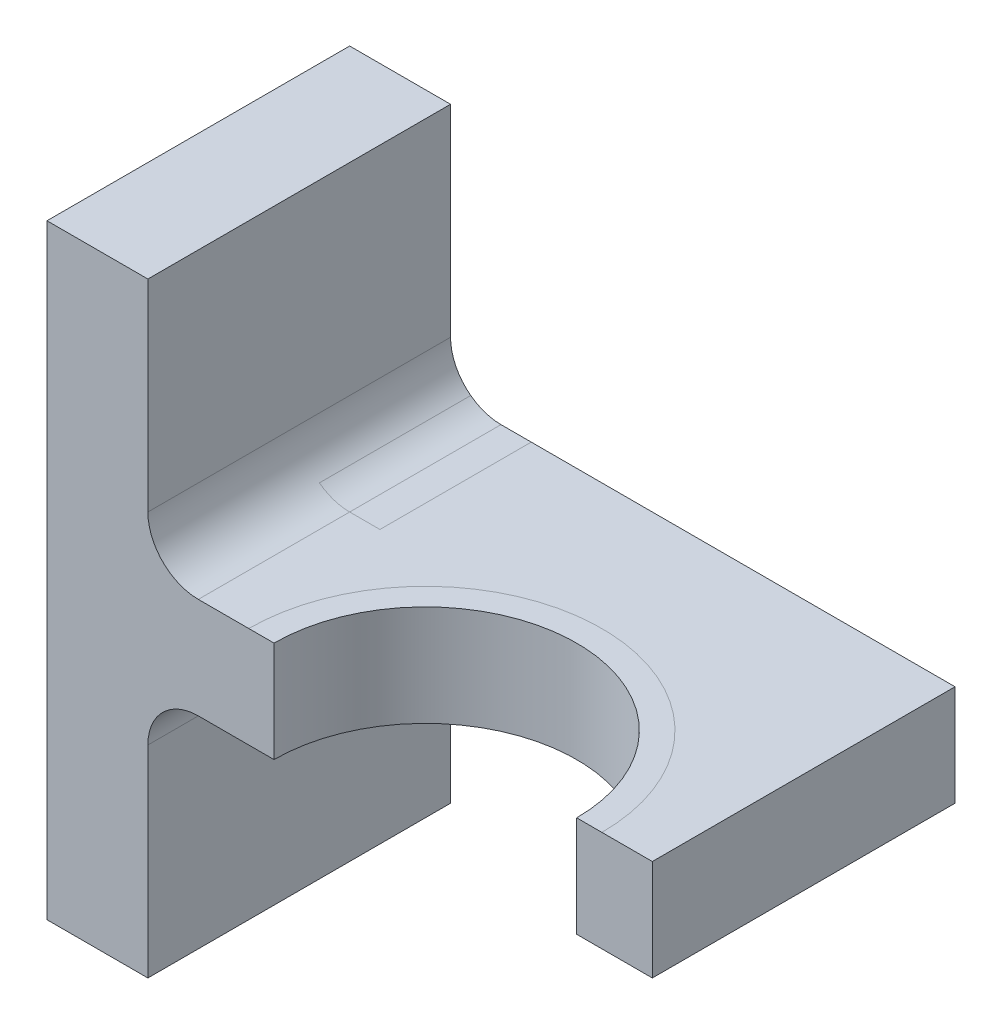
ISO-10303-21;
HEADER;
FILE_DESCRIPTION(('STEP AP214'),'2;1');
FILE_NAME('part.step','',(''),(''),'','','');
FILE_SCHEMA(('AUTOMOTIVE_DESIGN { 1 0 10303 214 1 1 1 1 }'));
ENDSEC;
DATA;
#1=APPLICATION_CONTEXT('core data for automotive mechanical design processes');
#2=APPLICATION_PROTOCOL_DEFINITION('international standard','automotive_design',2000,#1);
#3=PRODUCT_CONTEXT('',#1,'mechanical');
#4=PRODUCT('Part','Part','',(#3));
#5=PRODUCT_RELATED_PRODUCT_CATEGORY('part','',(#4));
#6=PRODUCT_DEFINITION_FORMATION('','',#4);
#7=PRODUCT_DEFINITION_CONTEXT('part definition',#1,'design');
#8=PRODUCT_DEFINITION('design','',#6,#7);
#9=PRODUCT_DEFINITION_SHAPE('','',#8);
#10=(LENGTH_UNIT() NAMED_UNIT(*) SI_UNIT(.MILLI.,.METRE.));
#11=(NAMED_UNIT(*) PLANE_ANGLE_UNIT() SI_UNIT($,.RADIAN.));
#12=(NAMED_UNIT(*) SI_UNIT($,.STERADIAN.) SOLID_ANGLE_UNIT());
#13=UNCERTAINTY_MEASURE_WITH_UNIT(LENGTH_MEASURE(1.E-05),#10,'distance_accuracy_value','');
#14=(GEOMETRIC_REPRESENTATION_CONTEXT(3) GLOBAL_UNCERTAINTY_ASSIGNED_CONTEXT((#13)) GLOBAL_UNIT_ASSIGNED_CONTEXT((#10,
#11,#12)) REPRESENTATION_CONTEXT('',''));
#15=CARTESIAN_POINT('',(0.,0.,0.));
#16=DIRECTION('',(0.,0.,1.));
#17=DIRECTION('',(1.,0.,0.));
#18=AXIS2_PLACEMENT_3D('',#15,#16,#17);
#19=CARTESIAN_POINT('',(20.,-10.,60.));
#20=DIRECTION('',(0.,1.,0.));
#21=DIRECTION('',(-1.,0.,0.));
#22=AXIS2_PLACEMENT_3D('',#19,#20,#21);
#23=PLANE('',#22);
#24=DIRECTION('',(-1.,0.,0.));
#25=VECTOR('',#24,1.);
#26=CARTESIAN_POINT('',(20.,-10.,-30.));
#27=LINE('',#26,#25);
#28=CARTESIAN_POINT('',(36.,-10.,-30.));
#29=VERTEX_POINT('',#28);
#30=CARTESIAN_POINT('',(30.,-10.,-30.));
#31=VERTEX_POINT('',#30);
#32=EDGE_CURVE('E11',#29,#31,#27,.T.);
#33=ORIENTED_EDGE('',*,*,#32,.F.);
#34=DIRECTION('',(0.,0.,1.));
#35=VECTOR('',#34,1.);
#36=CARTESIAN_POINT('',(36.,-10.,60.));
#37=LINE('',#36,#35);
#38=CARTESIAN_POINT('',(36.,-10.,-60.));
#39=VERTEX_POINT('',#38);
#40=EDGE_CURVE('E43',#39,#29,#37,.T.);
#41=ORIENTED_EDGE('',*,*,#40,.F.);
#42=DIRECTION('',(1.,0.,0.));
#43=VECTOR('',#42,1.);
#44=CARTESIAN_POINT('',(20.,-10.,-60.));
#45=LINE('',#44,#43);
#46=CARTESIAN_POINT('',(120.,-10.,-60.));
#47=VERTEX_POINT('',#46);
#48=EDGE_CURVE('E203',#39,#47,#45,.T.);
#49=ORIENTED_EDGE('',*,*,#48,.T.);
#50=DIRECTION('',(0.,0.,-1.));
#51=VECTOR('',#50,1.);
#52=CARTESIAN_POINT('',(120.,-10.,60.));
#53=LINE('',#52,#51);
#54=CARTESIAN_POINT('',(120.,-10.,0.));
#55=VERTEX_POINT('',#54);
#56=EDGE_CURVE('E226',#55,#47,#53,.T.);
#57=ORIENTED_EDGE('',*,*,#56,.F.);
#58=DIRECTION('',(-1.,0.,0.));
#59=VECTOR('',#58,1.);
#60=CARTESIAN_POINT('',(20.,-10.,0.));
#61=LINE('',#60,#59);
#62=CARTESIAN_POINT('',(110.,-10.,0.));
#63=VERTEX_POINT('',#62);
#64=EDGE_CURVE('E324',#55,#63,#61,.T.);
#65=ORIENTED_EDGE('',*,*,#64,.T.);
#66=CARTESIAN_POINT('',(75.,-10.,0.));
#67=DIRECTION('',(0.,1.,0.));
#68=DIRECTION('',(-1.,0.,0.));
#69=AXIS2_PLACEMENT_3D('',#66,#67,#68);
#70=CIRCLE('',#69,35.);
#71=CARTESIAN_POINT('',(40.,-10.,0.));
#72=VERTEX_POINT('',#71);
#73=EDGE_CURVE('E173',#72,#63,#70,.F.);
#74=ORIENTED_EDGE('',*,*,#73,.F.);
#75=CARTESIAN_POINT('',(30.,-10.,0.));
#76=VERTEX_POINT('',#75);
#77=EDGE_CURVE('E320',#72,#76,#61,.T.);
#78=ORIENTED_EDGE('',*,*,#77,.T.);
#79=DIRECTION('',(0.,0.,-1.));
#80=VECTOR('',#79,1.);
#81=CARTESIAN_POINT('',(30.,-10.,-60.));
#82=LINE('',#81,#80);
#83=EDGE_CURVE('E234',#76,#31,#82,.T.);
#84=ORIENTED_EDGE('',*,*,#83,.T.);
#85=EDGE_LOOP('',(#33,#41,#49,#57,#65,#74,#78,#84));
#86=FACE_BOUND('',#85,.T.);
#87=ADVANCED_FACE('F33',(#86),#23,.F.);
#88=CARTESIAN_POINT('',(30.,-20.,60.));
#89=DIRECTION('',(0.,0.,1.));
#90=DIRECTION('',(1.,0.,0.));
#91=AXIS2_PLACEMENT_3D('',#88,#89,#90);
#92=CYLINDRICAL_SURFACE('',#91,10.);
#93=DIRECTION('',(0.,0.,1.));
#94=VECTOR('',#93,1.);
#95=CARTESIAN_POINT('',(24.,-12.,60.));
#96=LINE('',#95,#94);
#97=CARTESIAN_POINT('',(24.,-12.,-30.));
#98=VERTEX_POINT('',#97);
#99=CARTESIAN_POINT('',(24.,-12.,-60.));
#100=VERTEX_POINT('',#99);
#101=EDGE_CURVE('E272',#98,#100,#96,.F.);
#102=ORIENTED_EDGE('',*,*,#101,.F.);
#103=CARTESIAN_POINT('',(30.,-20.,-30.));
#104=DIRECTION('',(0.,0.,-1.));
#105=DIRECTION('',(-1.,0.,0.));
#106=AXIS2_PLACEMENT_3D('',#103,#104,#105);
#107=CIRCLE('',#106,10.);
#108=EDGE_CURVE('E274',#31,#98,#107,.F.);
#109=ORIENTED_EDGE('',*,*,#108,.F.);
#110=ORIENTED_EDGE('',*,*,#83,.F.);
#111=CARTESIAN_POINT('',(30.,-20.,0.));
#112=DIRECTION('',(0.,0.,-1.));
#113=DIRECTION('',(-1.,0.,0.));
#114=AXIS2_PLACEMENT_3D('',#111,#112,#113);
#115=CIRCLE('',#114,10.);
#116=CARTESIAN_POINT('',(20.,-20.,0.));
#117=VERTEX_POINT('',#116);
#118=EDGE_CURVE('E331',#76,#117,#115,.F.);
#119=ORIENTED_EDGE('',*,*,#118,.T.);
#120=DIRECTION('',(0.,0.,-1.));
#121=VECTOR('',#120,1.);
#122=CARTESIAN_POINT('',(20.,-20.,60.));
#123=LINE('',#122,#121);
#124=CARTESIAN_POINT('',(20.,-20.,-60.));
#125=VERTEX_POINT('',#124);
#126=EDGE_CURVE('E236',#125,#117,#123,.F.);
#127=ORIENTED_EDGE('',*,*,#126,.F.);
#128=CARTESIAN_POINT('',(30.,-20.,-60.));
#129=DIRECTION('',(0.,0.,-1.));
#130=DIRECTION('',(-1.,0.,0.));
#131=AXIS2_PLACEMENT_3D('',#128,#129,#130);
#132=CIRCLE('',#131,10.);
#133=EDGE_CURVE('E245',#100,#125,#132,.F.);
#134=ORIENTED_EDGE('',*,*,#133,.F.);
#135=EDGE_LOOP('',(#102,#109,#110,#119,#127,#134));
#136=FACE_BOUND('',#135,.T.);
#137=ADVANCED_FACE('F364',(#136),#92,.F.);
#138=CARTESIAN_POINT('',(20.,10.,60.));
#139=DIRECTION('',(0.,-1.,0.));
#140=DIRECTION('',(1.,0.,0.));
#141=AXIS2_PLACEMENT_3D('',#138,#139,#140);
#142=PLANE('',#141);
#143=DIRECTION('',(1.,0.,0.));
#144=VECTOR('',#143,1.);
#145=CARTESIAN_POINT('',(20.,10.,-30.));
#146=LINE('',#145,#144);
#147=CARTESIAN_POINT('',(30.,10.,-30.));
#148=VERTEX_POINT('',#147);
#149=CARTESIAN_POINT('',(36.,10.,-30.));
#150=VERTEX_POINT('',#149);
#151=EDGE_CURVE('E37',#148,#150,#146,.T.);
#152=ORIENTED_EDGE('',*,*,#151,.F.);
#153=DIRECTION('',(0.,0.,-1.));
#154=VECTOR('',#153,1.);
#155=CARTESIAN_POINT('',(30.,10.,60.));
#156=LINE('',#155,#154);
#157=CARTESIAN_POINT('',(30.,10.,0.));
#158=VERTEX_POINT('',#157);
#159=EDGE_CURVE('E241',#148,#158,#156,.F.);
#160=ORIENTED_EDGE('',*,*,#159,.T.);
#161=DIRECTION('',(1.,0.,0.));
#162=VECTOR('',#161,1.);
#163=CARTESIAN_POINT('',(20.,10.,0.));
#164=LINE('',#163,#162);
#165=CARTESIAN_POINT('',(40.,10.,0.));
#166=VERTEX_POINT('',#165);
#167=EDGE_CURVE('E314',#158,#166,#164,.T.);
#168=ORIENTED_EDGE('',*,*,#167,.T.);
#169=CARTESIAN_POINT('',(75.,10.,0.));
#170=DIRECTION('',(0.,-1.,0.));
#171=DIRECTION('',(1.,0.,0.));
#172=AXIS2_PLACEMENT_3D('',#169,#170,#171);
#173=CIRCLE('',#172,35.);
#174=CARTESIAN_POINT('',(110.,10.,0.));
#175=VERTEX_POINT('',#174);
#176=EDGE_CURVE('E252',#175,#166,#173,.F.);
#177=ORIENTED_EDGE('',*,*,#176,.F.);
#178=CARTESIAN_POINT('',(120.,10.,0.));
#179=VERTEX_POINT('',#178);
#180=EDGE_CURVE('E182',#175,#179,#164,.T.);
#181=ORIENTED_EDGE('',*,*,#180,.T.);
#182=DIRECTION('',(0.,0.,-1.));
#183=VECTOR('',#182,1.);
#184=CARTESIAN_POINT('',(120.,10.,60.));
#185=LINE('',#184,#183);
#186=CARTESIAN_POINT('',(120.,10.,-60.));
#187=VERTEX_POINT('',#186);
#188=EDGE_CURVE('E224',#179,#187,#185,.T.);
#189=ORIENTED_EDGE('',*,*,#188,.T.);
#190=DIRECTION('',(-1.,0.,0.));
#191=VECTOR('',#190,1.);
#192=CARTESIAN_POINT('',(20.,10.,-60.));
#193=LINE('',#192,#191);
#194=CARTESIAN_POINT('',(36.,10.,-60.));
#195=VERTEX_POINT('',#194);
#196=EDGE_CURVE('E211',#187,#195,#193,.T.);
#197=ORIENTED_EDGE('',*,*,#196,.T.);
#198=DIRECTION('',(0.,0.,-1.));
#199=VECTOR('',#198,1.);
#200=CARTESIAN_POINT('',(36.,10.,60.));
#201=LINE('',#200,#199);
#202=EDGE_CURVE('E267',#150,#195,#201,.T.);
#203=ORIENTED_EDGE('',*,*,#202,.F.);
#204=EDGE_LOOP('',(#152,#160,#168,#177,#181,#189,#197,#203));
#205=FACE_BOUND('',#204,.T.);
#206=ADVANCED_FACE('F291',(#205),#142,.F.);
#207=CARTESIAN_POINT('',(30.,20.,60.));
#208=DIRECTION('',(0.,0.,1.));
#209=DIRECTION('',(1.,0.,0.));
#210=AXIS2_PLACEMENT_3D('',#207,#208,#209);
#211=CYLINDRICAL_SURFACE('',#210,10.);
#212=DIRECTION('',(0.,0.,1.));
#213=VECTOR('',#212,1.);
#214=CARTESIAN_POINT('',(24.,12.,60.));
#215=LINE('',#214,#213);
#216=CARTESIAN_POINT('',(24.,12.,-60.));
#217=VERTEX_POINT('',#216);
#218=CARTESIAN_POINT('',(24.,12.,-30.));
#219=VERTEX_POINT('',#218);
#220=EDGE_CURVE('E264',#217,#219,#215,.T.);
#221=ORIENTED_EDGE('',*,*,#220,.F.);
#222=CARTESIAN_POINT('',(30.,20.,-60.));
#223=DIRECTION('',(0.,0.,-1.));
#224=DIRECTION('',(-1.,0.,0.));
#225=AXIS2_PLACEMENT_3D('',#222,#223,#224);
#226=CIRCLE('',#225,10.);
#227=CARTESIAN_POINT('',(20.,20.,-60.));
#228=VERTEX_POINT('',#227);
#229=EDGE_CURVE('E250',#228,#217,#226,.F.);
#230=ORIENTED_EDGE('',*,*,#229,.F.);
#231=DIRECTION('',(0.,0.,-1.));
#232=VECTOR('',#231,1.);
#233=CARTESIAN_POINT('',(20.,20.,-60.));
#234=LINE('',#233,#232);
#235=CARTESIAN_POINT('',(20.,20.,0.));
#236=VERTEX_POINT('',#235);
#237=EDGE_CURVE('E239',#236,#228,#234,.T.);
#238=ORIENTED_EDGE('',*,*,#237,.F.);
#239=CARTESIAN_POINT('',(30.,20.,0.));
#240=DIRECTION('',(0.,0.,-1.));
#241=DIRECTION('',(-1.,0.,0.));
#242=AXIS2_PLACEMENT_3D('',#239,#240,#241);
#243=CIRCLE('',#242,10.);
#244=EDGE_CURVE('E310',#236,#158,#243,.F.);
#245=ORIENTED_EDGE('',*,*,#244,.T.);
#246=ORIENTED_EDGE('',*,*,#159,.F.);
#247=CARTESIAN_POINT('',(30.,20.,-30.));
#248=DIRECTION('',(0.,0.,-1.));
#249=DIRECTION('',(-1.,0.,0.));
#250=AXIS2_PLACEMENT_3D('',#247,#248,#249);
#251=CIRCLE('',#250,10.);
#252=EDGE_CURVE('E260',#219,#148,#251,.F.);
#253=ORIENTED_EDGE('',*,*,#252,.F.);
#254=EDGE_LOOP('',(#221,#230,#238,#245,#246,#253));
#255=FACE_BOUND('',#254,.T.);
#256=ADVANCED_FACE('F308',(#255),#211,.F.);
#257=CARTESIAN_POINT('',(-13.194139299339,272.307621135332,0.));
#258=DIRECTION('',(0.,0.,-1.));
#259=DIRECTION('',(-1.,0.,0.));
#260=AXIS2_PLACEMENT_3D('',#257,#258,#259);
#261=PLANE('',#260);
#262=DIRECTION('',(1.,0.,0.));
#263=VECTOR('',#262,1.);
#264=CARTESIAN_POINT('',(0.,60.,0.));
#265=LINE('',#264,#263);
#266=CARTESIAN_POINT('',(0.,60.,0.));
#267=VERTEX_POINT('',#266);
#268=CARTESIAN_POINT('',(20.,60.,0.));
#269=VERTEX_POINT('',#268);
#270=EDGE_CURVE('E193',#267,#269,#265,.T.);
#271=ORIENTED_EDGE('',*,*,#270,.F.);
#272=DIRECTION('',(0.,1.,0.));
#273=VECTOR('',#272,1.);
#274=CARTESIAN_POINT('',(0.,-60.,0.));
#275=LINE('',#274,#273);
#276=CARTESIAN_POINT('',(0.,-60.,0.));
#277=VERTEX_POINT('',#276);
#278=EDGE_CURVE('E341',#277,#267,#275,.T.);
#279=ORIENTED_EDGE('',*,*,#278,.F.);
#280=DIRECTION('',(-1.,0.,0.));
#281=VECTOR('',#280,1.);
#282=CARTESIAN_POINT('',(0.,-60.,0.));
#283=LINE('',#282,#281);
#284=CARTESIAN_POINT('',(20.,-60.,0.));
#285=VERTEX_POINT('',#284);
#286=EDGE_CURVE('E339',#285,#277,#283,.T.);
#287=ORIENTED_EDGE('',*,*,#286,.F.);
#288=DIRECTION('',(0.,-1.,0.));
#289=VECTOR('',#288,1.);
#290=CARTESIAN_POINT('',(20.,-60.,0.));
#291=LINE('',#290,#289);
#292=EDGE_CURVE('E336',#117,#285,#291,.T.);
#293=ORIENTED_EDGE('',*,*,#292,.F.);
#294=ORIENTED_EDGE('',*,*,#118,.F.);
#295=ORIENTED_EDGE('',*,*,#77,.F.);
#296=DIRECTION('',(-1.,0.,0.));
#297=VECTOR('',#296,1.);
#298=CARTESIAN_POINT('',(20.,-10.,0.));
#299=LINE('',#298,#297);
#300=CARTESIAN_POINT('',(45.,-10.,0.));
#301=VERTEX_POINT('',#300);
#302=EDGE_CURVE('E184',#301,#72,#299,.T.);
#303=ORIENTED_EDGE('',*,*,#302,.F.);
#304=DIRECTION('',(0.,1.,0.));
#305=VECTOR('',#304,1.);
#306=CARTESIAN_POINT('',(45.,-60.,0.));
#307=LINE('',#306,#305);
#308=CARTESIAN_POINT('',(45.,10.,0.));
#309=VERTEX_POINT('',#308);
#310=EDGE_CURVE('E172',#309,#301,#307,.F.);
#311=ORIENTED_EDGE('',*,*,#310,.F.);
#312=DIRECTION('',(1.,0.,0.));
#313=VECTOR('',#312,1.);
#314=CARTESIAN_POINT('',(20.,10.,0.));
#315=LINE('',#314,#313);
#316=EDGE_CURVE('E319',#166,#309,#315,.T.);
#317=ORIENTED_EDGE('',*,*,#316,.F.);
#318=ORIENTED_EDGE('',*,*,#167,.F.);
#319=ORIENTED_EDGE('',*,*,#244,.F.);
#320=DIRECTION('',(0.,-1.,0.));
#321=VECTOR('',#320,1.);
#322=CARTESIAN_POINT('',(20.,10.,0.));
#323=LINE('',#322,#321);
#324=EDGE_CURVE('E334',#269,#236,#323,.T.);
#325=ORIENTED_EDGE('',*,*,#324,.F.);
#326=EDGE_LOOP('',(#271,#279,#287,#293,#294,#295,#303,#311,#317,#318,#319,#325));
#327=FACE_BOUND('',#326,.T.);
#328=ADVANCED_FACE('F316',(#327),#261,.F.);
#329=ORIENTED_EDGE('',*,*,#40,.T.);
#330=ORIENTED_EDGE('',*,*,#32,.T.);
#331=CARTESIAN_POINT('',(30.,-10.,-60.));
#332=VERTEX_POINT('',#331);
#333=EDGE_CURVE('E233',#31,#332,#82,.T.);
#334=ORIENTED_EDGE('',*,*,#333,.T.);
#335=EDGE_CURVE('E204',#332,#39,#45,.T.);
#336=ORIENTED_EDGE('',*,*,#335,.T.);
#337=EDGE_LOOP('',(#329,#330,#334,#336));
#338=FACE_BOUND('',#337,.T.);
#339=ADVANCED_FACE('F368',(#338),#23,.F.);
#340=CARTESIAN_POINT('',(30.,10.,-60.));
#341=VERTEX_POINT('',#340);
#342=EDGE_CURVE('E242',#341,#148,#156,.F.);
#343=ORIENTED_EDGE('',*,*,#342,.T.);
#344=ORIENTED_EDGE('',*,*,#151,.T.);
#345=ORIENTED_EDGE('',*,*,#202,.T.);
#346=EDGE_CURVE('E210',#195,#341,#193,.T.);
#347=ORIENTED_EDGE('',*,*,#346,.T.);
#348=EDGE_LOOP('',(#343,#344,#345,#347));
#349=FACE_BOUND('',#348,.T.);
#350=ADVANCED_FACE('F287',(#349),#142,.F.);
#351=CARTESIAN_POINT('',(0.,-60.,60.));
#352=DIRECTION('',(1.,0.,0.));
#353=DIRECTION('',(0.,0.,-1.));
#354=AXIS2_PLACEMENT_3D('',#351,#352,#353);
#355=PLANE('',#354);
#356=DIRECTION('',(0.,0.,-1.));
#357=VECTOR('',#356,1.);
#358=CARTESIAN_POINT('',(0.,-60.,60.));
#359=LINE('',#358,#357);
#360=CARTESIAN_POINT('',(0.,-60.,-60.));
#361=VERTEX_POINT('',#360);
#362=EDGE_CURVE('E231',#277,#361,#359,.T.);
#363=ORIENTED_EDGE('',*,*,#362,.F.);
#364=ORIENTED_EDGE('',*,*,#278,.T.);
#365=DIRECTION('',(0.,0.,-1.));
#366=VECTOR('',#365,1.);
#367=CARTESIAN_POINT('',(0.,60.,60.));
#368=LINE('',#367,#366);
#369=CARTESIAN_POINT('',(0.,60.,-60.));
#370=VERTEX_POINT('',#369);
#371=EDGE_CURVE('E220',#267,#370,#368,.T.);
#372=ORIENTED_EDGE('',*,*,#371,.T.);
#373=DIRECTION('',(0.,-1.,0.));
#374=VECTOR('',#373,1.);
#375=CARTESIAN_POINT('',(0.,-60.,-60.));
#376=LINE('',#375,#374);
#377=EDGE_CURVE('E187',#370,#361,#376,.T.);
#378=ORIENTED_EDGE('',*,*,#377,.T.);
#379=EDGE_LOOP('',(#363,#364,#372,#378));
#380=FACE_BOUND('',#379,.T.);
#381=ADVANCED_FACE('F355',(#380),#355,.F.);
#382=CARTESIAN_POINT('',(0.,-60.,60.));
#383=DIRECTION('',(0.,1.,0.));
#384=DIRECTION('',(-1.,0.,0.));
#385=AXIS2_PLACEMENT_3D('',#382,#383,#384);
#386=PLANE('',#385);
#387=DIRECTION('',(0.,0.,-1.));
#388=VECTOR('',#387,1.);
#389=CARTESIAN_POINT('',(20.,-60.,60.));
#390=LINE('',#389,#388);
#391=CARTESIAN_POINT('',(20.,-60.,-60.));
#392=VERTEX_POINT('',#391);
#393=EDGE_CURVE('E229',#285,#392,#390,.T.);
#394=ORIENTED_EDGE('',*,*,#393,.F.);
#395=ORIENTED_EDGE('',*,*,#286,.T.);
#396=ORIENTED_EDGE('',*,*,#362,.T.);
#397=DIRECTION('',(1.,0.,0.));
#398=VECTOR('',#397,1.);
#399=CARTESIAN_POINT('',(0.,-60.,-60.));
#400=LINE('',#399,#398);
#401=EDGE_CURVE('E191',#361,#392,#400,.T.);
#402=ORIENTED_EDGE('',*,*,#401,.T.);
#403=EDGE_LOOP('',(#394,#395,#396,#402));
#404=FACE_BOUND('',#403,.T.);
#405=ADVANCED_FACE('F358',(#404),#386,.F.);
#406=CARTESIAN_POINT('',(20.,-60.,60.));
#407=DIRECTION('',(-1.,0.,0.));
#408=DIRECTION('',(0.,-1.,0.));
#409=AXIS2_PLACEMENT_3D('',#406,#407,#408);
#410=PLANE('',#409);
#411=ORIENTED_EDGE('',*,*,#126,.T.);
#412=ORIENTED_EDGE('',*,*,#292,.T.);
#413=ORIENTED_EDGE('',*,*,#393,.T.);
#414=DIRECTION('',(0.,1.,0.));
#415=VECTOR('',#414,1.);
#416=CARTESIAN_POINT('',(20.,-60.,-60.));
#417=LINE('',#416,#415);
#418=EDGE_CURVE('E200',#392,#125,#417,.T.);
#419=ORIENTED_EDGE('',*,*,#418,.T.);
#420=EDGE_LOOP('',(#411,#412,#413,#419));
#421=FACE_BOUND('',#420,.T.);
#422=ADVANCED_FACE('F360',(#421),#410,.F.);
#423=ORIENTED_EDGE('',*,*,#73,.T.);
#424=CARTESIAN_POINT('',(105.,-9.99999999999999,0.));
#425=VERTEX_POINT('',#424);
#426=EDGE_CURVE('E164',#63,#425,#299,.T.);
#427=ORIENTED_EDGE('',*,*,#426,.T.);
#428=CARTESIAN_POINT('',(75.,-10.,0.));
#429=DIRECTION('',(0.,1.,0.));
#430=DIRECTION('',(-1.,0.,0.));
#431=AXIS2_PLACEMENT_3D('',#428,#429,#430);
#432=CIRCLE('',#431,30.);
#433=EDGE_CURVE('E180',#425,#301,#432,.T.);
#434=ORIENTED_EDGE('',*,*,#433,.T.);
#435=ORIENTED_EDGE('',*,*,#302,.T.);
#436=EDGE_LOOP('',(#423,#427,#434,#435));
#437=FACE_BOUND('',#436,.T.);
#438=ADVANCED_FACE('F178',(#437),#23,.F.);
#439=CARTESIAN_POINT('',(120.,10.,60.));
#440=DIRECTION('',(-1.,0.,0.));
#441=DIRECTION('',(0.,0.,1.));
#442=AXIS2_PLACEMENT_3D('',#439,#440,#441);
#443=PLANE('',#442);
#444=ORIENTED_EDGE('',*,*,#188,.F.);
#445=DIRECTION('',(0.,-1.,0.));
#446=VECTOR('',#445,1.);
#447=CARTESIAN_POINT('',(120.,10.,0.));
#448=LINE('',#447,#446);
#449=EDGE_CURVE('E325',#179,#55,#448,.T.);
#450=ORIENTED_EDGE('',*,*,#449,.T.);
#451=ORIENTED_EDGE('',*,*,#56,.T.);
#452=DIRECTION('',(0.,1.,0.));
#453=VECTOR('',#452,1.);
#454=CARTESIAN_POINT('',(120.,10.,-60.));
#455=LINE('',#454,#453);
#456=EDGE_CURVE('E207',#47,#187,#455,.T.);
#457=ORIENTED_EDGE('',*,*,#456,.T.);
#458=EDGE_LOOP('',(#444,#450,#451,#457));
#459=FACE_BOUND('',#458,.T.);
#460=ADVANCED_FACE('F378',(#459),#443,.F.);
#461=ORIENTED_EDGE('',*,*,#176,.T.);
#462=ORIENTED_EDGE('',*,*,#316,.T.);
#463=CARTESIAN_POINT('',(75.,10.,0.));
#464=DIRECTION('',(0.,-1.,0.));
#465=DIRECTION('',(1.,0.,0.));
#466=AXIS2_PLACEMENT_3D('',#463,#464,#465);
#467=CIRCLE('',#466,30.);
#468=CARTESIAN_POINT('',(105.,10.,0.));
#469=VERTEX_POINT('',#468);
#470=EDGE_CURVE('E188',#309,#469,#467,.T.);
#471=ORIENTED_EDGE('',*,*,#470,.T.);
#472=EDGE_CURVE('E167',#469,#175,#315,.T.);
#473=ORIENTED_EDGE('',*,*,#472,.T.);
#474=EDGE_LOOP('',(#461,#462,#471,#473));
#475=FACE_BOUND('',#474,.T.);
#476=ADVANCED_FACE('F383',(#475),#142,.F.);
#477=CARTESIAN_POINT('',(20.,10.,60.));
#478=DIRECTION('',(-1.,0.,0.));
#479=DIRECTION('',(0.,-1.,0.));
#480=AXIS2_PLACEMENT_3D('',#477,#478,#479);
#481=PLANE('',#480);
#482=DIRECTION('',(0.,0.,-1.));
#483=VECTOR('',#482,1.);
#484=CARTESIAN_POINT('',(20.,60.,60.));
#485=LINE('',#484,#483);
#486=CARTESIAN_POINT('',(20.,60.,-60.));
#487=VERTEX_POINT('',#486);
#488=EDGE_CURVE('E222',#269,#487,#485,.T.);
#489=ORIENTED_EDGE('',*,*,#488,.F.);
#490=ORIENTED_EDGE('',*,*,#324,.T.);
#491=ORIENTED_EDGE('',*,*,#237,.T.);
#492=DIRECTION('',(0.,1.,0.));
#493=VECTOR('',#492,1.);
#494=CARTESIAN_POINT('',(20.,10.,-60.));
#495=LINE('',#494,#493);
#496=EDGE_CURVE('E214',#228,#487,#495,.T.);
#497=ORIENTED_EDGE('',*,*,#496,.T.);
#498=EDGE_LOOP('',(#489,#490,#491,#497));
#499=FACE_BOUND('',#498,.T.);
#500=ADVANCED_FACE('F351',(#499),#481,.F.);
#501=CARTESIAN_POINT('',(0.,60.,60.));
#502=DIRECTION('',(0.,-1.,0.));
#503=DIRECTION('',(0.,0.,-1.));
#504=AXIS2_PLACEMENT_3D('',#501,#502,#503);
#505=PLANE('',#504);
#506=ORIENTED_EDGE('',*,*,#371,.F.);
#507=ORIENTED_EDGE('',*,*,#270,.T.);
#508=ORIENTED_EDGE('',*,*,#488,.T.);
#509=DIRECTION('',(-1.,0.,0.));
#510=VECTOR('',#509,1.);
#511=CARTESIAN_POINT('',(0.,60.,-60.));
#512=LINE('',#511,#510);
#513=EDGE_CURVE('E217',#487,#370,#512,.T.);
#514=ORIENTED_EDGE('',*,*,#513,.T.);
#515=EDGE_LOOP('',(#506,#507,#508,#514));
#516=FACE_BOUND('',#515,.T.);
#517=ADVANCED_FACE('F349',(#516),#505,.F.);
#518=CARTESIAN_POINT('',(0.,60.,-60.));
#519=DIRECTION('',(0.,0.,-1.));
#520=DIRECTION('',(-1.,0.,0.));
#521=AXIS2_PLACEMENT_3D('',#518,#519,#520);
#522=PLANE('',#521);
#523=ORIENTED_EDGE('',*,*,#377,.F.);
#524=ORIENTED_EDGE('',*,*,#513,.F.);
#525=ORIENTED_EDGE('',*,*,#496,.F.);
#526=ORIENTED_EDGE('',*,*,#229,.T.);
#527=EDGE_CURVE('E249',#217,#341,#226,.F.);
#528=ORIENTED_EDGE('',*,*,#527,.T.);
#529=ORIENTED_EDGE('',*,*,#346,.F.);
#530=ORIENTED_EDGE('',*,*,#196,.F.);
#531=ORIENTED_EDGE('',*,*,#456,.F.);
#532=ORIENTED_EDGE('',*,*,#48,.F.);
#533=ORIENTED_EDGE('',*,*,#335,.F.);
#534=EDGE_CURVE('E246',#332,#100,#132,.F.);
#535=ORIENTED_EDGE('',*,*,#534,.T.);
#536=ORIENTED_EDGE('',*,*,#133,.T.);
#537=ORIENTED_EDGE('',*,*,#418,.F.);
#538=ORIENTED_EDGE('',*,*,#401,.F.);
#539=EDGE_LOOP('',(#523,#524,#525,#526,#528,#529,#530,#531,#532,#533,#535,#536,#537,#538));
#540=FACE_BOUND('',#539,.T.);
#541=ADVANCED_FACE('F298',(#540),#522,.T.);
#542=ORIENTED_EDGE('',*,*,#108,.T.);
#543=ORIENTED_EDGE('',*,*,#101,.T.);
#544=ORIENTED_EDGE('',*,*,#534,.F.);
#545=ORIENTED_EDGE('',*,*,#333,.F.);
#546=EDGE_LOOP('',(#542,#543,#544,#545));
#547=FACE_BOUND('',#546,.T.);
#548=ADVANCED_FACE('F372',(#547),#92,.F.);
#549=ORIENTED_EDGE('',*,*,#527,.F.);
#550=ORIENTED_EDGE('',*,*,#220,.T.);
#551=ORIENTED_EDGE('',*,*,#252,.T.);
#552=ORIENTED_EDGE('',*,*,#342,.F.);
#553=EDGE_LOOP('',(#549,#550,#551,#552));
#554=FACE_BOUND('',#553,.T.);
#555=ADVANCED_FACE('F35',(#554),#211,.F.);
#556=CARTESIAN_POINT('',(75.,-60.,0.));
#557=DIRECTION('',(0.,1.,0.));
#558=DIRECTION('',(0.,0.,1.));
#559=AXIS2_PLACEMENT_3D('',#556,#557,#558);
#560=CYLINDRICAL_SURFACE('',#559,30.);
#561=ORIENTED_EDGE('',*,*,#470,.F.);
#562=ORIENTED_EDGE('',*,*,#310,.T.);
#563=ORIENTED_EDGE('',*,*,#433,.F.);
#564=DIRECTION('',(0.,1.,0.));
#565=VECTOR('',#564,1.);
#566=CARTESIAN_POINT('',(105.,-60.,0.));
#567=LINE('',#566,#565);
#568=EDGE_CURVE('E161',#425,#469,#567,.T.);
#569=ORIENTED_EDGE('',*,*,#568,.T.);
#570=EDGE_LOOP('',(#561,#562,#563,#569));
#571=FACE_BOUND('',#570,.T.);
#572=ADVANCED_FACE('F186',(#571),#560,.F.);
#573=ORIENTED_EDGE('',*,*,#449,.F.);
#574=ORIENTED_EDGE('',*,*,#180,.F.);
#575=ORIENTED_EDGE('',*,*,#472,.F.);
#576=ORIENTED_EDGE('',*,*,#568,.F.);
#577=ORIENTED_EDGE('',*,*,#426,.F.);
#578=ORIENTED_EDGE('',*,*,#64,.F.);
#579=EDGE_LOOP('',(#573,#574,#575,#576,#577,#578));
#580=FACE_BOUND('',#579,.T.);
#581=ADVANCED_FACE('F163',(#580),#261,.F.);
#582=CLOSED_SHELL('',(#87,#137,#206,#256,#328,#339,#350,#381,#405,#422,#438,#460,#476,#500,#517,
#541,#548,#555,#572,#581));
#583=MANIFOLD_SOLID_BREP('B2',#582);
#584=ADVANCED_BREP_SHAPE_REPRESENTATION('',(#18,#583),#14);
#585=SHAPE_DEFINITION_REPRESENTATION(#9,#584);
ENDSEC;
END-ISO-10303-21;
